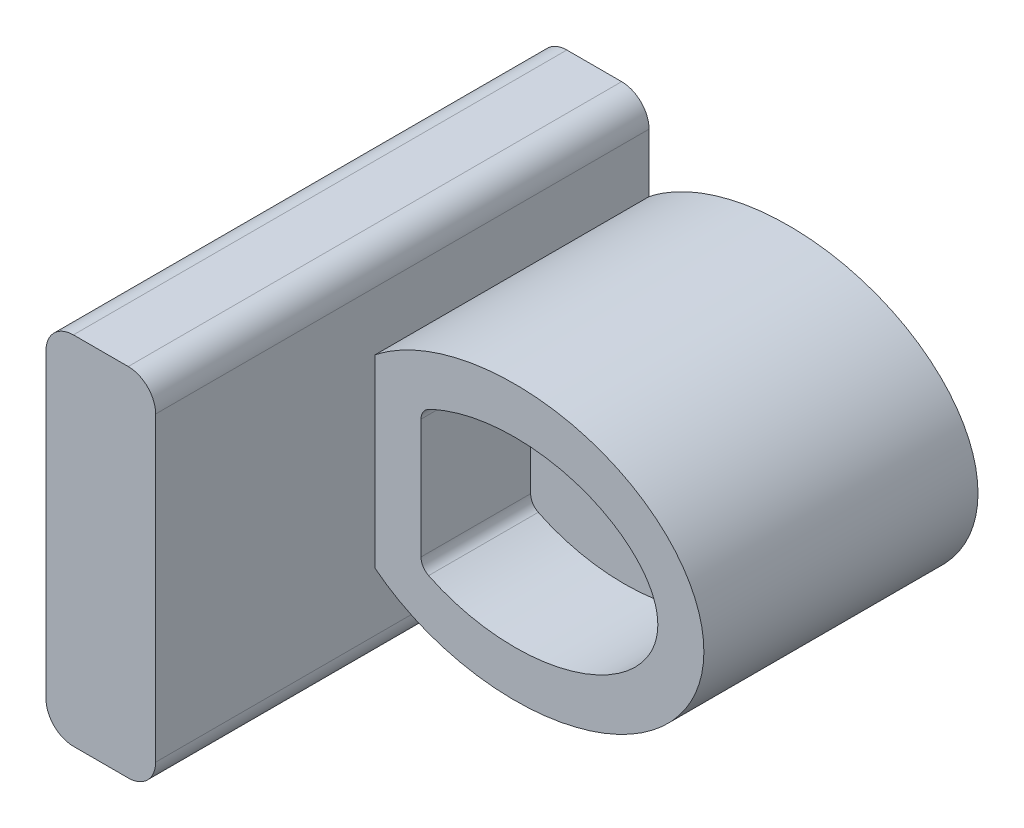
ISO-10303-21;
HEADER;
FILE_DESCRIPTION(('STEP AP214'),'2;1');
FILE_NAME('part.step','',(''),(''),'','','');
FILE_SCHEMA(('AUTOMOTIVE_DESIGN { 1 0 10303 214 1 1 1 1 }'));
ENDSEC;
DATA;
#1=APPLICATION_CONTEXT('core data for automotive mechanical design processes');
#2=APPLICATION_PROTOCOL_DEFINITION('international standard','automotive_design',2000,#1);
#3=PRODUCT_CONTEXT('',#1,'mechanical');
#4=PRODUCT('Part','Part','',(#3));
#5=PRODUCT_RELATED_PRODUCT_CATEGORY('part','',(#4));
#6=PRODUCT_DEFINITION_FORMATION('','',#4);
#7=PRODUCT_DEFINITION_CONTEXT('part definition',#1,'design');
#8=PRODUCT_DEFINITION('design','',#6,#7);
#9=PRODUCT_DEFINITION_SHAPE('','',#8);
#10=(LENGTH_UNIT() NAMED_UNIT(*) SI_UNIT(.MILLI.,.METRE.));
#11=(NAMED_UNIT(*) PLANE_ANGLE_UNIT() SI_UNIT($,.RADIAN.));
#12=(NAMED_UNIT(*) SI_UNIT($,.STERADIAN.) SOLID_ANGLE_UNIT());
#13=UNCERTAINTY_MEASURE_WITH_UNIT(LENGTH_MEASURE(1.E-05),#10,'distance_accuracy_value','');
#14=(GEOMETRIC_REPRESENTATION_CONTEXT(3) GLOBAL_UNCERTAINTY_ASSIGNED_CONTEXT((#13)) GLOBAL_UNIT_ASSIGNED_CONTEXT((#10,
#11,#12)) REPRESENTATION_CONTEXT('',''));
#15=CARTESIAN_POINT('',(0.,0.,0.));
#16=DIRECTION('',(0.,0.,1.));
#17=DIRECTION('',(1.,0.,0.));
#18=AXIS2_PLACEMENT_3D('',#15,#16,#17);
#19=CARTESIAN_POINT('',(100.000000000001,324.999999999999,900.000000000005));
#20=DIRECTION('',(-1.00000000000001,0.,0.));
#21=DIRECTION('',(0.,0.,1.));
#22=AXIS2_PLACEMENT_3D('',#19,#20,#21);
#23=PLANE('',#22);
#24=DIRECTION('',(0.,0.,-1.));
#25=VECTOR('',#24,1.);
#26=CARTESIAN_POINT('',(100.000000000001,-168.390580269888,500.000000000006));
#27=LINE('',#26,#25);
#28=CARTESIAN_POINT('',(100.000000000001,-168.390580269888,500.000000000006));
#29=VERTEX_POINT('',#28);
#30=CARTESIAN_POINT('',(100.000000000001,-168.390580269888,0.));
#31=VERTEX_POINT('',#30);
#32=EDGE_CURVE('E1195',#29,#31,#27,.T.);
#33=ORIENTED_EDGE('',*,*,#32,.F.);
#34=DIRECTION('',(0.,1.00000000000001,0.));
#35=VECTOR('',#34,1.);
#36=CARTESIAN_POINT('',(100.000000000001,324.999999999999,500.));
#37=LINE('',#36,#35);
#38=CARTESIAN_POINT('',(100.000000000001,168.390580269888,500.000000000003));
#39=VERTEX_POINT('',#38);
#40=EDGE_CURVE('E1191',#29,#39,#37,.T.);
#41=ORIENTED_EDGE('',*,*,#40,.T.);
#42=DIRECTION('',(0.,0.,-1.));
#43=VECTOR('',#42,1.);
#44=CARTESIAN_POINT('',(100.000000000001,168.390580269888,500.000000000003));
#45=LINE('',#44,#43);
#46=CARTESIAN_POINT('',(99.9999999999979,168.390580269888,0.));
#47=VERTEX_POINT('',#46);
#48=EDGE_CURVE('E1189',#47,#39,#45,.F.);
#49=ORIENTED_EDGE('',*,*,#48,.F.);
#50=DIRECTION('',(0.,1.00000000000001,0.));
#51=VECTOR('',#50,1.);
#52=CARTESIAN_POINT('',(99.9999999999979,324.999999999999,0.));
#53=LINE('',#52,#51);
#54=CARTESIAN_POINT('',(99.9999999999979,275.,0.));
#55=VERTEX_POINT('',#54);
#56=EDGE_CURVE('E1175',#47,#55,#53,.T.);
#57=ORIENTED_EDGE('',*,*,#56,.T.);
#58=DIRECTION('',(0.,0.,-1.));
#59=VECTOR('',#58,1.);
#60=CARTESIAN_POINT('',(100.000000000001,275.,900.000000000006));
#61=LINE('',#60,#59);
#62=CARTESIAN_POINT('',(100.000000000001,275.,900.000000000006));
#63=VERTEX_POINT('',#62);
#64=EDGE_CURVE('E1293',#55,#63,#61,.F.);
#65=ORIENTED_EDGE('',*,*,#64,.T.);
#66=DIRECTION('',(0.,1.00000000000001,0.));
#67=VECTOR('',#66,1.);
#68=CARTESIAN_POINT('',(100.000000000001,324.999999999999,900.000000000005));
#69=LINE('',#68,#67);
#70=CARTESIAN_POINT('',(100.000000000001,-275.000000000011,900.000000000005));
#71=VERTEX_POINT('',#70);
#72=EDGE_CURVE('E1263',#71,#63,#69,.T.);
#73=ORIENTED_EDGE('',*,*,#72,.F.);
#74=DIRECTION('',(0.,0.,-1.));
#75=VECTOR('',#74,1.);
#76=CARTESIAN_POINT('',(100.000000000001,-275.000000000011,900.000000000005));
#77=LINE('',#76,#75);
#78=CARTESIAN_POINT('',(100.000000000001,-275.000000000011,0.));
#79=VERTEX_POINT('',#78);
#80=EDGE_CURVE('E1295',#71,#79,#77,.T.);
#81=ORIENTED_EDGE('',*,*,#80,.T.);
#82=EDGE_CURVE('E1185',#79,#31,#53,.T.);
#83=ORIENTED_EDGE('',*,*,#82,.T.);
#84=EDGE_LOOP('',(#33,#41,#49,#57,#65,#73,#81,#83));
#85=FACE_BOUND('',#84,.T.);
#86=ADVANCED_FACE('F1072',(#85),#23,.F.);
#87=CARTESIAN_POINT('',(-99.9999999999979,324.999999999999,900.000000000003));
#88=DIRECTION('',(1.00000000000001,0.,0.));
#89=DIRECTION('',(0.,0.,-1.));
#90=AXIS2_PLACEMENT_3D('',#87,#88,#89);
#91=PLANE('',#90);
#92=DIRECTION('',(0.,-1.00000000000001,0.));
#93=VECTOR('',#92,1.);
#94=CARTESIAN_POINT('',(-100.000000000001,324.999999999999,0.));
#95=LINE('',#94,#93);
#96=CARTESIAN_POINT('',(-100.000000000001,275.,0.));
#97=VERTEX_POINT('',#96);
#98=CARTESIAN_POINT('',(-99.9999999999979,-275.000000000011,0.));
#99=VERTEX_POINT('',#98);
#100=EDGE_CURVE('E1490',#97,#99,#95,.T.);
#101=ORIENTED_EDGE('',*,*,#100,.T.);
#102=DIRECTION('',(0.,0.,-1.));
#103=VECTOR('',#102,1.);
#104=CARTESIAN_POINT('',(-99.9999999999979,-275.000000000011,900.000000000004));
#105=LINE('',#104,#103);
#106=CARTESIAN_POINT('',(-99.9999999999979,-275.000000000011,900.000000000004));
#107=VERTEX_POINT('',#106);
#108=EDGE_CURVE('E1284',#99,#107,#105,.F.);
#109=ORIENTED_EDGE('',*,*,#108,.T.);
#110=DIRECTION('',(0.,-1.00000000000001,0.));
#111=VECTOR('',#110,1.);
#112=CARTESIAN_POINT('',(-99.9999999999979,324.999999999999,900.000000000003));
#113=LINE('',#112,#111);
#114=CARTESIAN_POINT('',(-99.9999999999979,275.,900.000000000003));
#115=VERTEX_POINT('',#114);
#116=EDGE_CURVE('E1264',#115,#107,#113,.T.);
#117=ORIENTED_EDGE('',*,*,#116,.F.);
#118=DIRECTION('',(0.,0.,-1.));
#119=VECTOR('',#118,1.);
#120=CARTESIAN_POINT('',(-99.9999999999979,275.,900.000000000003));
#121=LINE('',#120,#119);
#122=EDGE_CURVE('E1281',#115,#97,#121,.T.);
#123=ORIENTED_EDGE('',*,*,#122,.T.);
#124=EDGE_LOOP('',(#101,#109,#117,#123));
#125=FACE_BOUND('',#124,.T.);
#126=ADVANCED_FACE('F1074',(#125),#91,.F.);
#127=CARTESIAN_POINT('',(-99.9999999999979,-325.00000000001,900.000000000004));
#128=DIRECTION('',(0.,1.00000000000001,0.));
#129=DIRECTION('',(0.,0.,1.));
#130=AXIS2_PLACEMENT_3D('',#127,#128,#129);
#131=PLANE('',#130);
#132=DIRECTION('',(1.00000000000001,0.,0.));
#133=VECTOR('',#132,1.);
#134=CARTESIAN_POINT('',(-99.9999999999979,-325.00000000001,900.000000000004));
#135=LINE('',#134,#133);
#136=CARTESIAN_POINT('',(-50.0000000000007,-325.00000000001,900.000000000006));
#137=VERTEX_POINT('',#136);
#138=CARTESIAN_POINT('',(50.0000000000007,-325.00000000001,900.000000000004));
#139=VERTEX_POINT('',#138);
#140=EDGE_CURVE('E1255',#137,#139,#135,.T.);
#141=ORIENTED_EDGE('',*,*,#140,.F.);
#142=DIRECTION('',(0.,0.,-1.));
#143=VECTOR('',#142,1.);
#144=CARTESIAN_POINT('',(-50.0000000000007,-325.00000000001,900.000000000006));
#145=LINE('',#144,#143);
#146=CARTESIAN_POINT('',(-50.0000000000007,-325.00000000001,0.));
#147=VERTEX_POINT('',#146);
#148=EDGE_CURVE('E1258',#137,#147,#145,.T.);
#149=ORIENTED_EDGE('',*,*,#148,.T.);
#150=DIRECTION('',(1.00000000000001,0.,0.));
#151=VECTOR('',#150,1.);
#152=CARTESIAN_POINT('',(-99.9999999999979,-325.00000000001,0.));
#153=LINE('',#152,#151);
#154=CARTESIAN_POINT('',(50.0000000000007,-325.00000000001,0.));
#155=VERTEX_POINT('',#154);
#156=EDGE_CURVE('E1186',#147,#155,#153,.T.);
#157=ORIENTED_EDGE('',*,*,#156,.T.);
#158=DIRECTION('',(0.,0.,-1.));
#159=VECTOR('',#158,1.);
#160=CARTESIAN_POINT('',(50.0000000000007,-325.00000000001,900.000000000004));
#161=LINE('',#160,#159);
#162=EDGE_CURVE('E1261',#155,#139,#161,.F.);
#163=ORIENTED_EDGE('',*,*,#162,.T.);
#164=EDGE_LOOP('',(#141,#149,#157,#163));
#165=FACE_BOUND('',#164,.T.);
#166=ADVANCED_FACE('F1243',(#165),#131,.F.);
#167=CARTESIAN_POINT('',(-99.9999999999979,324.999999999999,900.000000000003));
#168=DIRECTION('',(0.,-1.00000000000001,0.));
#169=DIRECTION('',(0.,0.,-1.));
#170=AXIS2_PLACEMENT_3D('',#167,#168,#169);
#171=PLANE('',#170);
#172=DIRECTION('',(-1.00000000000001,0.,0.));
#173=VECTOR('',#172,1.);
#174=CARTESIAN_POINT('',(-99.9999999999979,324.999999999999,900.000000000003));
#175=LINE('',#174,#173);
#176=CARTESIAN_POINT('',(50.0000000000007,324.999999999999,900.000000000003));
#177=VERTEX_POINT('',#176);
#178=CARTESIAN_POINT('',(-50.0000000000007,324.999999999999,900.000000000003));
#179=VERTEX_POINT('',#178);
#180=EDGE_CURVE('E1273',#177,#179,#175,.T.);
#181=ORIENTED_EDGE('',*,*,#180,.F.);
#182=DIRECTION('',(0.,0.,-1.));
#183=VECTOR('',#182,1.);
#184=CARTESIAN_POINT('',(50.0000000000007,324.999999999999,900.000000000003));
#185=LINE('',#184,#183);
#186=CARTESIAN_POINT('',(50.0000000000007,324.999999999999,0.));
#187=VERTEX_POINT('',#186);
#188=EDGE_CURVE('E1300',#177,#187,#185,.T.);
#189=ORIENTED_EDGE('',*,*,#188,.T.);
#190=DIRECTION('',(-1.00000000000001,0.,0.));
#191=VECTOR('',#190,1.);
#192=CARTESIAN_POINT('',(-100.000000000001,324.999999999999,0.));
#193=LINE('',#192,#191);
#194=CARTESIAN_POINT('',(-50.0000000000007,324.999999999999,0.));
#195=VERTEX_POINT('',#194);
#196=EDGE_CURVE('E1475',#187,#195,#193,.T.);
#197=ORIENTED_EDGE('',*,*,#196,.T.);
#198=DIRECTION('',(0.,0.,-1.));
#199=VECTOR('',#198,1.);
#200=CARTESIAN_POINT('',(-50.0000000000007,324.999999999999,900.000000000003));
#201=LINE('',#200,#199);
#202=EDGE_CURVE('E1298',#195,#179,#201,.F.);
#203=ORIENTED_EDGE('',*,*,#202,.T.);
#204=EDGE_LOOP('',(#181,#189,#197,#203));
#205=FACE_BOUND('',#204,.T.);
#206=ADVANCED_FACE('F1239',(#205),#171,.F.);
#207=CARTESIAN_POINT('',(-99.9999999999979,-325.00000000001,900.000000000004));
#208=DIRECTION('',(0.,0.,1.));
#209=DIRECTION('',(1.00000000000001,0.,0.));
#210=AXIS2_PLACEMENT_3D('',#207,#208,#209);
#211=PLANE('',#210);
#212=ORIENTED_EDGE('',*,*,#116,.T.);
#213=CARTESIAN_POINT('',(-50.0000000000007,-275.000000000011,900.000000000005));
#214=DIRECTION('',(0.,0.,1.));
#215=DIRECTION('',(1.00000000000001,0.,0.));
#216=AXIS2_PLACEMENT_3D('',#213,#214,#215);
#217=CIRCLE('',#216,50.);
#218=EDGE_CURVE('E1268',#107,#137,#217,.T.);
#219=ORIENTED_EDGE('',*,*,#218,.T.);
#220=ORIENTED_EDGE('',*,*,#140,.T.);
#221=CARTESIAN_POINT('',(50.0000000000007,-275.000000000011,900.000000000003));
#222=DIRECTION('',(0.,0.,1.));
#223=DIRECTION('',(1.00000000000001,0.,0.));
#224=AXIS2_PLACEMENT_3D('',#221,#222,#223);
#225=CIRCLE('',#224,50.);
#226=EDGE_CURVE('E1290',#139,#71,#225,.T.);
#227=ORIENTED_EDGE('',*,*,#226,.T.);
#228=ORIENTED_EDGE('',*,*,#72,.T.);
#229=CARTESIAN_POINT('',(50.0000000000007,275.,900.000000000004));
#230=DIRECTION('',(0.,0.,1.));
#231=DIRECTION('',(1.00000000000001,0.,0.));
#232=AXIS2_PLACEMENT_3D('',#229,#230,#231);
#233=CIRCLE('',#232,50.);
#234=EDGE_CURVE('E1288',#63,#177,#233,.T.);
#235=ORIENTED_EDGE('',*,*,#234,.T.);
#236=ORIENTED_EDGE('',*,*,#180,.T.);
#237=CARTESIAN_POINT('',(-50.0000000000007,275.,900.000000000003));
#238=DIRECTION('',(0.,0.,1.));
#239=DIRECTION('',(1.00000000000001,0.,0.));
#240=AXIS2_PLACEMENT_3D('',#237,#238,#239);
#241=CIRCLE('',#240,50.);
#242=EDGE_CURVE('E1286',#179,#115,#241,.T.);
#243=ORIENTED_EDGE('',*,*,#242,.T.);
#244=EDGE_LOOP('',(#212,#219,#220,#227,#228,#235,#236,#243));
#245=FACE_BOUND('',#244,.T.);
#246=ADVANCED_FACE('F1236',(#245),#211,.T.);
#247=CARTESIAN_POINT('',(-99.9999999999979,-325.00000000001,0.));
#248=DIRECTION('',(0.,0.,1.));
#249=DIRECTION('',(1.00000000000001,0.,0.));
#250=AXIS2_PLACEMENT_3D('',#247,#248,#249);
#251=PLANE('',#250);
#252=ORIENTED_EDGE('',*,*,#56,.F.);
#253=CARTESIAN_POINT('',(355.000000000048,0.,0.));
#254=DIRECTION('',(0.,0.,1.));
#255=DIRECTION('',(-1.00000000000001,0.,0.));
#256=AXIS2_PLACEMENT_3D('',#253,#254,#255);
#257=ELLIPSE('',#256,345.,250.);
#258=EDGE_CURVE('E1180',#31,#47,#257,.T.);
#259=ORIENTED_EDGE('',*,*,#258,.F.);
#260=ORIENTED_EDGE('',*,*,#82,.F.);
#261=CARTESIAN_POINT('',(50.0000000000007,-275.000000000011,0.));
#262=DIRECTION('',(0.,0.,1.));
#263=DIRECTION('',(1.00000000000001,0.,0.));
#264=AXIS2_PLACEMENT_3D('',#261,#262,#263);
#265=CIRCLE('',#264,50.);
#266=EDGE_CURVE('E1278',#79,#155,#265,.F.);
#267=ORIENTED_EDGE('',*,*,#266,.T.);
#268=ORIENTED_EDGE('',*,*,#156,.F.);
#269=CARTESIAN_POINT('',(-50.0000000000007,-275.000000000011,0.));
#270=DIRECTION('',(0.,0.,1.));
#271=DIRECTION('',(1.00000000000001,0.,0.));
#272=AXIS2_PLACEMENT_3D('',#269,#270,#271);
#273=CIRCLE('',#272,50.);
#274=EDGE_CURVE('E1269',#147,#99,#273,.F.);
#275=ORIENTED_EDGE('',*,*,#274,.T.);
#276=ORIENTED_EDGE('',*,*,#100,.F.);
#277=CARTESIAN_POINT('',(-50.0000000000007,275.,0.));
#278=DIRECTION('',(0.,0.,1.));
#279=DIRECTION('',(1.00000000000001,0.,0.));
#280=AXIS2_PLACEMENT_3D('',#277,#278,#279);
#281=CIRCLE('',#280,50.);
#282=EDGE_CURVE('E1270',#97,#195,#281,.F.);
#283=ORIENTED_EDGE('',*,*,#282,.T.);
#284=ORIENTED_EDGE('',*,*,#196,.F.);
#285=CARTESIAN_POINT('',(50.0000000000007,275.,0.));
#286=DIRECTION('',(0.,0.,1.));
#287=DIRECTION('',(1.00000000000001,0.,0.));
#288=AXIS2_PLACEMENT_3D('',#285,#286,#287);
#289=CIRCLE('',#288,50.);
#290=EDGE_CURVE('E1182',#187,#55,#289,.F.);
#291=ORIENTED_EDGE('',*,*,#290,.T.);
#292=EDGE_LOOP('',(#252,#259,#260,#267,#268,#275,#276,#283,#284,#291));
#293=FACE_BOUND('',#292,.T.);
#294=ADVANCED_FACE('F1177',(#293),#251,.F.);
#295=CARTESIAN_POINT('',(-50.0000000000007,-275.000000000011,900.000000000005));
#296=DIRECTION('',(0.,0.,-1.));
#297=DIRECTION('',(-1.00000000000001,0.,0.));
#298=AXIS2_PLACEMENT_3D('',#295,#296,#297);
#299=CYLINDRICAL_SURFACE('',#298,50.);
#300=ORIENTED_EDGE('',*,*,#218,.F.);
#301=ORIENTED_EDGE('',*,*,#108,.F.);
#302=ORIENTED_EDGE('',*,*,#274,.F.);
#303=ORIENTED_EDGE('',*,*,#148,.F.);
#304=EDGE_LOOP('',(#300,#301,#302,#303));
#305=FACE_BOUND('',#304,.T.);
#306=ADVANCED_FACE('F1229',(#305),#299,.T.);
#307=CARTESIAN_POINT('',(50.0000000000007,-275.000000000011,900.000000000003));
#308=DIRECTION('',(0.,0.,-1.));
#309=DIRECTION('',(-1.00000000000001,0.,0.));
#310=AXIS2_PLACEMENT_3D('',#307,#308,#309);
#311=CYLINDRICAL_SURFACE('',#310,50.);
#312=ORIENTED_EDGE('',*,*,#226,.F.);
#313=ORIENTED_EDGE('',*,*,#162,.F.);
#314=ORIENTED_EDGE('',*,*,#266,.F.);
#315=ORIENTED_EDGE('',*,*,#80,.F.);
#316=EDGE_LOOP('',(#312,#313,#314,#315));
#317=FACE_BOUND('',#316,.T.);
#318=ADVANCED_FACE('F1225',(#317),#311,.T.);
#319=CARTESIAN_POINT('',(50.0000000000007,275.,900.000000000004));
#320=DIRECTION('',(0.,0.,-1.));
#321=DIRECTION('',(-1.00000000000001,0.,0.));
#322=AXIS2_PLACEMENT_3D('',#319,#320,#321);
#323=CYLINDRICAL_SURFACE('',#322,50.);
#324=ORIENTED_EDGE('',*,*,#234,.F.);
#325=ORIENTED_EDGE('',*,*,#64,.F.);
#326=ORIENTED_EDGE('',*,*,#290,.F.);
#327=ORIENTED_EDGE('',*,*,#188,.F.);
#328=EDGE_LOOP('',(#324,#325,#326,#327));
#329=FACE_BOUND('',#328,.T.);
#330=ADVANCED_FACE('F1221',(#329),#323,.T.);
#331=CARTESIAN_POINT('',(-50.0000000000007,275.,900.000000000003));
#332=DIRECTION('',(0.,0.,-1.));
#333=DIRECTION('',(-1.00000000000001,0.,0.));
#334=AXIS2_PLACEMENT_3D('',#331,#332,#333);
#335=CYLINDRICAL_SURFACE('',#334,50.);
#336=ORIENTED_EDGE('',*,*,#242,.F.);
#337=ORIENTED_EDGE('',*,*,#202,.F.);
#338=ORIENTED_EDGE('',*,*,#282,.F.);
#339=ORIENTED_EDGE('',*,*,#122,.F.);
#340=EDGE_LOOP('',(#336,#337,#338,#339));
#341=FACE_BOUND('',#340,.T.);
#342=ADVANCED_FACE('F1218',(#341),#335,.T.);
#343=CARTESIAN_POINT('',(355.000000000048,0.,500.));
#344=DIRECTION('',(0.,0.,1.));
#345=DIRECTION('',(1.00000000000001,0.,0.));
#346=AXIS2_PLACEMENT_3D('',#343,#344,#345);
#347=PLANE('',#346);
#348=CARTESIAN_POINT('',(197.932725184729,-131.284545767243,500.));
#349=CARTESIAN_POINT('',(198.0631544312,-131.348939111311,500.));
#350=CARTESIAN_POINT('',(198.193621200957,-131.413228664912,500.));
#351=CARTESIAN_POINT('',(203.151743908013,-133.851788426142,500.));
#352=CARTESIAN_POINT('',(208.03060389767,-136.084426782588,500.));
#353=CARTESIAN_POINT('',(222.80981291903,-142.387825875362,499.999999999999));
#354=CARTESIAN_POINT('',(232.852073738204,-146.066054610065,499.999999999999));
#355=CARTESIAN_POINT('',(253.279093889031,-152.475151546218,500.));
#356=CARTESIAN_POINT('',(263.664109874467,-155.205309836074,500.));
#357=CARTESIAN_POINT('',(276.849909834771,-158.052272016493,500.));
#358=CARTESIAN_POINT('',(279.499889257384,-158.593745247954,500.));
#359=CARTESIAN_POINT('',(284.807524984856,-159.617703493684,500.));
#360=CARTESIAN_POINT('',(287.462975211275,-160.099832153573,500.));
#361=CARTESIAN_POINT('',(295.434123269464,-161.45849009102,500.));
#362=CARTESIAN_POINT('',(300.75461354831,-162.247381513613,500.));
#363=CARTESIAN_POINT('',(316.734653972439,-164.274480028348,500.000000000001));
#364=CARTESIAN_POINT('',(327.412708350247,-165.174306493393,500.000000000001));
#365=CARTESIAN_POINT('',(348.816727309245,-166.097841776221,500.));
#366=CARTESIAN_POINT('',(359.542695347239,-166.121487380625,500.));
#367=CARTESIAN_POINT('',(375.66803484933,-165.491550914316,500.));
#368=CARTESIAN_POINT('',(381.049228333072,-165.170383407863,500.));
#369=CARTESIAN_POINT('',(389.130346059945,-164.518063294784,499.999999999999));
#370=CARTESIAN_POINT('',(391.821648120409,-164.272442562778,499.999999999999));
#371=CARTESIAN_POINT('',(397.184915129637,-163.726252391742,499.999999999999));
#372=CARTESIAN_POINT('',(399.859081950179,-163.425510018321,499.999999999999));
#373=CARTESIAN_POINT('',(413.192657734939,-161.783839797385,499.999999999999));
#374=CARTESIAN_POINT('',(423.740710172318,-160.030586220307,499.999999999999));
#375=CARTESIAN_POINT('',(444.594510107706,-155.626883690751,499.999999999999));
#376=CARTESIAN_POINT('',(454.900350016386,-152.976776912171,499.999999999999));
#377=CARTESIAN_POINT('',(475.253270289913,-146.718440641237,500.));
#378=CARTESIAN_POINT('',(485.300598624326,-143.111129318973,500.));
#379=CARTESIAN_POINT('',(500.152781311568,-136.88996360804,500.));
#380=CARTESIAN_POINT('',(505.066891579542,-134.680656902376,500.));
#381=CARTESIAN_POINT('',(512.378157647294,-131.144904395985,500.));
#382=CARTESIAN_POINT('',(514.807204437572,-129.928147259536,500.));
#383=CARTESIAN_POINT('',(519.614398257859,-127.432738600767,500.));
#384=CARTESIAN_POINT('',(521.996023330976,-126.15248137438,500.));
#385=CARTESIAN_POINT('',(529.073173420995,-122.211369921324,500.000000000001));
#386=CARTESIAN_POINT('',(533.701122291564,-119.450396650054,500.000000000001));
#387=CARTESIAN_POINT('',(542.76390788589,-113.642340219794,500.000000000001));
#388=CARTESIAN_POINT('',(547.198808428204,-110.595351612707,500.000000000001));
#389=CARTESIAN_POINT('',(555.857265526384,-104.188252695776,500.000000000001));
#390=CARTESIAN_POINT('',(560.080933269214,-100.82830711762,500.000000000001));
#391=CARTESIAN_POINT('',(565.212019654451,-96.4083639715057,500.000000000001));
#392=CARTESIAN_POINT('',(566.230787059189,-95.5133378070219,500.000000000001));
#393=CARTESIAN_POINT('',(568.252898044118,-93.7004339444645,500.000000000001));
#394=CARTESIAN_POINT('',(569.257094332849,-92.781735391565,500.000000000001));
#395=CARTESIAN_POINT('',(572.234781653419,-90.0004046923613,500.000000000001));
#396=CARTESIAN_POINT('',(574.175950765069,-88.1103982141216,500.000000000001));
#397=CARTESIAN_POINT('',(579.861822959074,-82.3283249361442,500.000000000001));
#398=CARTESIAN_POINT('',(583.469466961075,-78.3246732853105,500.000000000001));
#399=CARTESIAN_POINT('',(590.276454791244,-69.9849577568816,500.000000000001));
#400=CARTESIAN_POINT('',(593.476159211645,-65.6491874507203,500.000000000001));
#401=CARTESIAN_POINT('',(597.921080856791,-58.8568105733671,500.000000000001));
#402=CARTESIAN_POINT('',(599.343408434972,-56.5443960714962,500.000000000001));
#403=CARTESIAN_POINT('',(601.379356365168,-52.9963606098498,500.000000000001));
#404=CARTESIAN_POINT('',(602.039992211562,-51.8033452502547,500.000000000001));
#405=CARTESIAN_POINT('',(603.319627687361,-49.4045970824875,500.000000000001));
#406=CARTESIAN_POINT('',(603.939360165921,-48.1975954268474,500.000000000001));
#407=CARTESIAN_POINT('',(606.935236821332,-42.1235532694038,500.000000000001));
#408=CARTESIAN_POINT('',(609.004344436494,-37.1399126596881,500.000000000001));
#409=CARTESIAN_POINT('',(611.556365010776,-29.4549607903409,500.000000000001));
#410=CARTESIAN_POINT('',(612.314838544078,-26.858296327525,500.000000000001));
#411=CARTESIAN_POINT('',(613.304029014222,-22.9068977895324,500.000000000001));
#412=CARTESIAN_POINT('',(613.608985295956,-21.5803568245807,500.000000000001));
#413=CARTESIAN_POINT('',(614.16738219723,-18.9077113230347,500.000000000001));
#414=CARTESIAN_POINT('',(614.420479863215,-17.562419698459,500.000000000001));
#415=CARTESIAN_POINT('',(615.542780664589,-10.8512305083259,500.000000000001));
#416=CARTESIAN_POINT('',(615.99401236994,-5.48023575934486,500.000000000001));
#417=CARTESIAN_POINT('',(616.005869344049,5.26582858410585,500.000000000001));
#418=CARTESIAN_POINT('',(615.566495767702,10.6408981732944,500.000000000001));
#419=CARTESIAN_POINT('',(614.456545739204,17.3623007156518,500.000000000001));
#420=CARTESIAN_POINT('',(614.205867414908,18.709334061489,500.000000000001));
#421=CARTESIAN_POINT('',(613.653151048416,21.3811798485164,500.000000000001));
#422=CARTESIAN_POINT('',(613.350896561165,22.7079948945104,500.000000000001));
#423=CARTESIAN_POINT('',(612.369196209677,26.6620843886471,500.000000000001));
#424=CARTESIAN_POINT('',(611.614889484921,29.2630299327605,500.000000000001));
#425=CARTESIAN_POINT('',(609.071562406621,36.9672461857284,500.000000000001));
#426=CARTESIAN_POINT('',(607.003127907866,41.9722456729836,500.000000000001));
#427=CARTESIAN_POINT('',(603.998412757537,48.0810703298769,500.000000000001));
#428=CARTESIAN_POINT('',(603.375351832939,49.2974223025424,500.));
#429=CARTESIAN_POINT('',(602.094215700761,51.7041937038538,500.));
#430=CARTESIAN_POINT('',(601.436358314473,52.8944106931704,500.));
#431=CARTESIAN_POINT('',(599.413344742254,56.4274037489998,500.));
#432=CARTESIAN_POINT('',(597.998822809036,58.7325795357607,500.));
#433=CARTESIAN_POINT('',(593.574015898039,65.5100614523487,500.));
#434=CARTESIAN_POINT('',(590.383279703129,69.8449237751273,500.));
#435=CARTESIAN_POINT('',(583.582387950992,78.1951903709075,500.));
#436=CARTESIAN_POINT('',(579.971902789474,82.2103435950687,500.));
#437=CARTESIAN_POINT('',(574.271437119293,88.0161978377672,500.));
#438=CARTESIAN_POINT('',(572.319503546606,89.9189479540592,500.));
#439=CARTESIAN_POINT('',(568.355761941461,93.6258523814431,500.));
#440=CARTESIAN_POINT('',(566.341866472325,95.4324976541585,500.));
#441=CARTESIAN_POINT('',(560.210651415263,100.721579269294,500.));
#442=CARTESIAN_POINT('',(556.004089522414,104.07357992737,499.999999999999));
#443=CARTESIAN_POINT('',(547.37901843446,110.467801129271,499.999999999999));
#444=CARTESIAN_POINT('',(542.96040020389,113.509862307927,499.999999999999));
#445=CARTESIAN_POINT('',(533.929195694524,119.310482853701,499.999999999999));
#446=CARTESIAN_POINT('',(529.316546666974,122.068950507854,499.999999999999));
#447=CARTESIAN_POINT('',(519.909846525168,127.320750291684,500.));
#448=CARTESIAN_POINT('',(515.114773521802,129.814504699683,500.));
#449=CARTESIAN_POINT('',(505.355784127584,134.54750333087,500.));
#450=CARTESIAN_POINT('',(500.433628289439,136.766652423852,500.));
#451=CARTESIAN_POINT('',(485.549515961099,143.017758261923,500.));
#452=CARTESIAN_POINT('',(475.470544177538,146.645547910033,500.));
#453=CARTESIAN_POINT('',(455.034747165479,152.941430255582,500.));
#454=CARTESIAN_POINT('',(444.677667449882,155.608643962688,499.999999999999));
#455=CARTESIAN_POINT('',(428.945836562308,158.931756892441,499.999999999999));
#456=CARTESIAN_POINT('',(423.669075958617,159.926112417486,499.999999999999));
#457=CARTESIAN_POINT('',(415.705348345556,161.249828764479,500.));
#458=CARTESIAN_POINT('',(413.042668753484,161.663077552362,500.));
#459=CARTESIAN_POINT('',(407.70113913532,162.433722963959,500.));
#460=CARTESIAN_POINT('',(405.019843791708,162.791411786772,500.));
#461=CARTESIAN_POINT('',(391.602659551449,164.436584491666,500.));
#462=CARTESIAN_POINT('',(380.878665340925,165.291516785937,500.));
#463=CARTESIAN_POINT('',(359.449282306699,166.121574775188,500.000000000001));
#464=CARTESIAN_POINT('',(348.743897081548,166.096530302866,500.));
#465=CARTESIAN_POINT('',(327.351664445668,165.169830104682,500.));
#466=CARTESIAN_POINT('',(316.66481456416,164.268291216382,500.));
#467=CARTESIAN_POINT('',(300.648990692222,162.232630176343,500.));
#468=CARTESIAN_POINT('',(295.312797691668,161.439878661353,500.));
#469=CARTESIAN_POINT('',(284.645421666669,159.61746520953,500.));
#470=CARTESIAN_POINT('',(279.349310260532,158.593748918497,500.));
#471=CARTESIAN_POINT('',(263.58018040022,155.183468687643,500.));
#472=CARTESIAN_POINT('',(253.223366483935,152.458872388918,500.));
#473=CARTESIAN_POINT('',(232.837909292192,146.06040065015,499.999999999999));
#474=CARTESIAN_POINT('',(222.809007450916,142.387273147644,499.999999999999));
#475=CARTESIAN_POINT('',(208.03863254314,136.087955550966,499.999999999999));
#476=CARTESIAN_POINT('',(203.160845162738,133.856073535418,499.999999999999));
#477=CARTESIAN_POINT('',(198.199134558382,131.415945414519,499.999999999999));
#478=CARTESIAN_POINT('',(198.065913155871,131.350301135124,499.999999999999));
#479=CARTESIAN_POINT('',(197.932729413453,131.28454791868,499.999999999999));
#480=B_SPLINE_CURVE_WITH_KNOTS('',3,(#348,#349,#350,#351,#352,#353,#354,#355,#356,#357,#358,
#359,#360,#361,#362,#363,#364,#365,#366,#367,#368,#369,#370,#371,#372,#373,#374,#375,#376,#377,
#378,#379,#380,#381,#382,#383,#384,#385,#386,#387,#388,#389,#390,#391,#392,#393,#394,#395,#396,
#397,#398,#399,#400,#401,#402,#403,#404,#405,#406,#407,#408,#409,#410,#411,#412,#413,#414,#415,
#416,#417,#418,#419,#420,#421,#422,#423,#424,#425,#426,#427,#428,#429,#430,#431,#432,#433,#434,
#435,#436,#437,#438,#439,#440,#441,#442,#443,#444,#445,#446,#447,#448,#449,#450,#451,#452,#453,
#454,#455,#456,#457,#458,#459,#460,#461,#462,#463,#464,#465,#466,#467,#468,#469,#470,#471,#472,
#473,#474,#475,#476,#477,#478,#479),.UNSPECIFIED.,.F.,.F.,(4,2,2,2,2,2,2,2,2,2,2,2,2,2,2,2,2,2,
2,2,2,2,2,2,2,2,2,2,2,2,2,2,2,2,2,2,2,2,2,2,2,2,2,2,2,2,2,2,2,2,2,2,2,2,2,2,2,2,2,2,2,2,2,2,2,
4),(0.0152026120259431,0.0156250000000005,0.031250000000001,0.062500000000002,0.093750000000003,
0.101562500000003,0.109375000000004,0.125000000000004,0.156250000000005,0.187500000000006,
0.203125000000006,0.210937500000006,0.218750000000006,0.250000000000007,0.281250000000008,
0.312500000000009,0.328125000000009,0.335937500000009,0.343750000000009,0.359375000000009,
0.375000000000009,0.390625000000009,0.39453125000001,0.39843750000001,0.40625000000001,
0.42187500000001,0.43750000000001,0.44531250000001,0.44921875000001,0.45312500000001,
0.46875000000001,0.47656250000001,0.480468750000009,0.484375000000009,0.500000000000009,
0.515625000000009,0.519531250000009,0.523437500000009,0.531250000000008,0.546875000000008,
0.550781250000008,0.554687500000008,0.562500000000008,0.578125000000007,0.593750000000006,
0.601562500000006,0.609375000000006,0.625000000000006,0.640625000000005,0.656250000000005,
0.671875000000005,0.687500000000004,0.718750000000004,0.750000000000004,0.765625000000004,
0.773437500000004,0.781250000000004,0.812500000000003,0.843750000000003,0.875000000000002,
0.890625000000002,0.906250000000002,0.937500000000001,0.968750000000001,0.984375,
0.984806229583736),.UNSPECIFIED.);
#481=CARTESIAN_POINT('',(197.932601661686,-131.284795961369,499.999999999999));
#482=VERTEX_POINT('',#481);
#483=CARTESIAN_POINT('',(197.932602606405,131.28480476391,499.999999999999));
#484=VERTEX_POINT('',#483);
#485=EDGE_CURVE('E1318',#482,#484,#480,.T.);
#486=ORIENTED_EDGE('',*,*,#485,.F.);
#487=CARTESIAN_POINT('',(209.000000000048,-108.86768987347,499.999999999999));
#488=DIRECTION('',(0.,0.,1.));
#489=DIRECTION('',(1.00000000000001,0.,0.));
#490=AXIS2_PLACEMENT_3D('',#487,#488,#489);
#491=CIRCLE('',#490,25.);
#492=CARTESIAN_POINT('',(184.000000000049,-108.86768987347,499.999999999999));
#493=VERTEX_POINT('',#492);
#494=EDGE_CURVE('E1081',#482,#493,#491,.F.);
#495=ORIENTED_EDGE('',*,*,#494,.T.);
#496=DIRECTION('',(0.,-1.00000000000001,0.));
#497=VECTOR('',#496,1.);
#498=CARTESIAN_POINT('',(184.000000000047,123.915241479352,499.999999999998));
#499=LINE('',#498,#497);
#500=CARTESIAN_POINT('',(184.000000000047,108.867689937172,499.999999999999));
#501=VERTEX_POINT('',#500);
#502=EDGE_CURVE('E1369',#501,#493,#499,.T.);
#503=ORIENTED_EDGE('',*,*,#502,.F.);
#504=CARTESIAN_POINT('',(209.000000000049,108.867689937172,499.999999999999));
#505=DIRECTION('',(0.,0.,1.));
#506=DIRECTION('',(1.00000000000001,0.,0.));
#507=AXIS2_PLACEMENT_3D('',#504,#505,#506);
#508=CIRCLE('',#507,25.);
#509=EDGE_CURVE('E11',#501,#484,#508,.F.);
#510=ORIENTED_EDGE('',*,*,#509,.T.);
#511=EDGE_LOOP('',(#486,#495,#503,#510));
#512=FACE_BOUND('',#511,.T.);
#513=ORIENTED_EDGE('',*,*,#40,.F.);
#514=CARTESIAN_POINT('',(355.000000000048,0.,500.));
#515=DIRECTION('',(0.,0.,1.));
#516=DIRECTION('',(-1.00000000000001,0.,0.));
#517=AXIS2_PLACEMENT_3D('',#514,#515,#516);
#518=ELLIPSE('',#517,345.,250.);
#519=EDGE_CURVE('E1196',#29,#39,#518,.T.);
#520=ORIENTED_EDGE('',*,*,#519,.T.);
#521=EDGE_LOOP('',(#513,#520));
#522=FACE_BOUND('',#521,.T.);
#523=ADVANCED_FACE('F1215',(#512,#522),#347,.T.);
#524=DIRECTION('',(0.,0.,-1.));
#525=VECTOR('',#524,1.);
#526=SURFACE_OF_LINEAR_EXTRUSION('',#518,#525);
#527=ORIENTED_EDGE('',*,*,#519,.F.);
#528=ORIENTED_EDGE('',*,*,#32,.T.);
#529=ORIENTED_EDGE('',*,*,#258,.T.);
#530=ORIENTED_EDGE('',*,*,#48,.T.);
#531=EDGE_LOOP('',(#527,#528,#529,#530));
#532=FACE_BOUND('',#531,.T.);
#533=ADVANCED_FACE('F1199',(#532),#526,.F.);
#534=CARTESIAN_POINT('',(184.000000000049,-123.915241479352,300.));
#535=CARTESIAN_POINT('',(188.720097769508,-126.587020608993,300.));
#536=CARTESIAN_POINT('',(193.496506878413,-129.103040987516,300.));
#537=CARTESIAN_POINT('',(203.151743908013,-133.851788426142,300.));
#538=CARTESIAN_POINT('',(208.03060389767,-136.084426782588,300.));
#539=CARTESIAN_POINT('',(222.80981291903,-142.387825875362,299.999999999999));
#540=CARTESIAN_POINT('',(232.852073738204,-146.066054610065,299.999999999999));
#541=CARTESIAN_POINT('',(253.279093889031,-152.475151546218,300.));
#542=CARTESIAN_POINT('',(263.664109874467,-155.205309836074,300.));
#543=CARTESIAN_POINT('',(276.849909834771,-158.052272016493,300.));
#544=CARTESIAN_POINT('',(279.499889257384,-158.593745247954,300.));
#545=CARTESIAN_POINT('',(284.807524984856,-159.617703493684,300.000000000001));
#546=CARTESIAN_POINT('',(287.462975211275,-160.099832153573,300.000000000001));
#547=CARTESIAN_POINT('',(295.434123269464,-161.45849009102,300.000000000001));
#548=CARTESIAN_POINT('',(300.75461354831,-162.247381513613,300.000000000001));
#549=CARTESIAN_POINT('',(316.734653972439,-164.274480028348,300.000000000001));
#550=CARTESIAN_POINT('',(327.412708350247,-165.174306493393,300.000000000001));
#551=CARTESIAN_POINT('',(348.816727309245,-166.097841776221,300.));
#552=CARTESIAN_POINT('',(359.542695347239,-166.121487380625,300.));
#553=CARTESIAN_POINT('',(375.66803484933,-165.491550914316,300.));
#554=CARTESIAN_POINT('',(381.049228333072,-165.170383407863,300.));
#555=CARTESIAN_POINT('',(389.130346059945,-164.518063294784,299.999999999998));
#556=CARTESIAN_POINT('',(391.821648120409,-164.272442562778,299.999999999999));
#557=CARTESIAN_POINT('',(397.184915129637,-163.726252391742,299.999999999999));
#558=CARTESIAN_POINT('',(399.859081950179,-163.425510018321,299.999999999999));
#559=CARTESIAN_POINT('',(413.192657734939,-161.783839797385,299.999999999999));
#560=CARTESIAN_POINT('',(423.740710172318,-160.030586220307,299.999999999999));
#561=CARTESIAN_POINT('',(444.594510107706,-155.626883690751,299.999999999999));
#562=CARTESIAN_POINT('',(454.900350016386,-152.976776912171,299.999999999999));
#563=CARTESIAN_POINT('',(475.253270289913,-146.718440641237,300.));
#564=CARTESIAN_POINT('',(485.300598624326,-143.111129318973,300.));
#565=CARTESIAN_POINT('',(500.152781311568,-136.88996360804,300.));
#566=CARTESIAN_POINT('',(505.066891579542,-134.680656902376,300.));
#567=CARTESIAN_POINT('',(512.378157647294,-131.144904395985,300.));
#568=CARTESIAN_POINT('',(514.807204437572,-129.928147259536,300.));
#569=CARTESIAN_POINT('',(519.614398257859,-127.432738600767,300.));
#570=CARTESIAN_POINT('',(521.996023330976,-126.15248137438,300.));
#571=CARTESIAN_POINT('',(529.073173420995,-122.211369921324,300.000000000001));
#572=CARTESIAN_POINT('',(533.701122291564,-119.450396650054,300.000000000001));
#573=CARTESIAN_POINT('',(542.76390788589,-113.642340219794,300.000000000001));
#574=CARTESIAN_POINT('',(547.198808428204,-110.595351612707,300.000000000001));
#575=CARTESIAN_POINT('',(555.857265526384,-104.188252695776,300.000000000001));
#576=CARTESIAN_POINT('',(560.080933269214,-100.82830711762,300.000000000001));
#577=CARTESIAN_POINT('',(565.212019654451,-96.4083639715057,300.000000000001));
#578=CARTESIAN_POINT('',(566.230787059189,-95.5133378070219,300.000000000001));
#579=CARTESIAN_POINT('',(568.252898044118,-93.7004339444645,300.000000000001));
#580=CARTESIAN_POINT('',(569.257094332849,-92.781735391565,300.000000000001));
#581=CARTESIAN_POINT('',(572.234781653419,-90.0004046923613,300.000000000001));
#582=CARTESIAN_POINT('',(574.175950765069,-88.1103982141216,300.000000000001));
#583=CARTESIAN_POINT('',(579.861822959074,-82.3283249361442,300.000000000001));
#584=CARTESIAN_POINT('',(583.469466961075,-78.3246732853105,300.000000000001));
#585=CARTESIAN_POINT('',(590.276454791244,-69.9849577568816,300.000000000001));
#586=CARTESIAN_POINT('',(593.476159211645,-65.6491874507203,300.000000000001));
#587=CARTESIAN_POINT('',(597.921080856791,-58.8568105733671,300.000000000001));
#588=CARTESIAN_POINT('',(599.343408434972,-56.5443960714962,300.000000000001));
#589=CARTESIAN_POINT('',(601.379356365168,-52.9963606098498,300.000000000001));
#590=CARTESIAN_POINT('',(602.039992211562,-51.8033452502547,300.000000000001));
#591=CARTESIAN_POINT('',(603.319627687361,-49.4045970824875,300.000000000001));
#592=CARTESIAN_POINT('',(603.939360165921,-48.1975954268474,300.000000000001));
#593=CARTESIAN_POINT('',(606.935236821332,-42.1235532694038,300.000000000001));
#594=CARTESIAN_POINT('',(609.004344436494,-37.1399126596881,300.000000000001));
#595=CARTESIAN_POINT('',(611.556365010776,-29.4549607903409,300.000000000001));
#596=CARTESIAN_POINT('',(612.314838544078,-26.858296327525,300.000000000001));
#597=CARTESIAN_POINT('',(613.304029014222,-22.9068977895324,300.000000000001));
#598=CARTESIAN_POINT('',(613.608985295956,-21.5803568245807,300.000000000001));
#599=CARTESIAN_POINT('',(614.16738219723,-18.9077113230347,300.000000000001));
#600=CARTESIAN_POINT('',(614.420479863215,-17.562419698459,300.000000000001));
#601=CARTESIAN_POINT('',(615.542780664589,-10.8512305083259,300.000000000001));
#602=CARTESIAN_POINT('',(615.99401236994,-5.48023575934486,300.000000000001));
#603=CARTESIAN_POINT('',(616.005869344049,5.26582858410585,300.000000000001));
#604=CARTESIAN_POINT('',(615.566495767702,10.6408981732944,300.000000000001));
#605=CARTESIAN_POINT('',(614.456545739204,17.3623007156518,300.000000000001));
#606=CARTESIAN_POINT('',(614.205867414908,18.709334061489,300.000000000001));
#607=CARTESIAN_POINT('',(613.653151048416,21.3811798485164,300.000000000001));
#608=CARTESIAN_POINT('',(613.350896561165,22.7079948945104,300.000000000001));
#609=CARTESIAN_POINT('',(612.369196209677,26.6620843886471,300.000000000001));
#610=CARTESIAN_POINT('',(611.614889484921,29.2630299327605,300.000000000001));
#611=CARTESIAN_POINT('',(609.071562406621,36.9672461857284,300.000000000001));
#612=CARTESIAN_POINT('',(607.003127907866,41.9722456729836,300.000000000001));
#613=CARTESIAN_POINT('',(603.998412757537,48.0810703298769,300.000000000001));
#614=CARTESIAN_POINT('',(603.375351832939,49.2974223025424,300.000000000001));
#615=CARTESIAN_POINT('',(602.094215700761,51.7041937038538,300.000000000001));
#616=CARTESIAN_POINT('',(601.436358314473,52.8944106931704,300.000000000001));
#617=CARTESIAN_POINT('',(599.413344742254,56.4274037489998,300.000000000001));
#618=CARTESIAN_POINT('',(597.998822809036,58.7325795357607,300.000000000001));
#619=CARTESIAN_POINT('',(593.574015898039,65.5100614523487,300.000000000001));
#620=CARTESIAN_POINT('',(590.383279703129,69.8449237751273,300.000000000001));
#621=CARTESIAN_POINT('',(583.582387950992,78.1951903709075,300.000000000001));
#622=CARTESIAN_POINT('',(579.971902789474,82.2103435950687,300.));
#623=CARTESIAN_POINT('',(574.271437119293,88.0161978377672,300.));
#624=CARTESIAN_POINT('',(572.319503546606,89.9189479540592,300.));
#625=CARTESIAN_POINT('',(568.355761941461,93.6258523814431,300.));
#626=CARTESIAN_POINT('',(566.341866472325,95.4324976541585,300.));
#627=CARTESIAN_POINT('',(560.210651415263,100.721579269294,300.));
#628=CARTESIAN_POINT('',(556.004089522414,104.07357992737,299.999999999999));
#629=CARTESIAN_POINT('',(547.37901843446,110.467801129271,299.999999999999));
#630=CARTESIAN_POINT('',(542.96040020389,113.509862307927,299.999999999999));
#631=CARTESIAN_POINT('',(533.929195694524,119.310482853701,299.999999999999));
#632=CARTESIAN_POINT('',(529.316546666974,122.068950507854,299.999999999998));
#633=CARTESIAN_POINT('',(519.909846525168,127.320750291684,300.));
#634=CARTESIAN_POINT('',(515.114773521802,129.814504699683,300.));
#635=CARTESIAN_POINT('',(505.355784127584,134.54750333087,300.));
#636=CARTESIAN_POINT('',(500.433628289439,136.766652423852,300.));
#637=CARTESIAN_POINT('',(485.549515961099,143.017758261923,300.));
#638=CARTESIAN_POINT('',(475.470544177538,146.645547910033,300.));
#639=CARTESIAN_POINT('',(455.034747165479,152.941430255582,300.));
#640=CARTESIAN_POINT('',(444.677667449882,155.608643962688,299.999999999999));
#641=CARTESIAN_POINT('',(428.945836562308,158.931756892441,299.999999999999));
#642=CARTESIAN_POINT('',(423.669075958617,159.926112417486,299.999999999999));
#643=CARTESIAN_POINT('',(415.705348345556,161.249828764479,300.));
#644=CARTESIAN_POINT('',(413.042668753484,161.663077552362,300.));
#645=CARTESIAN_POINT('',(407.70113913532,162.433722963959,300.));
#646=CARTESIAN_POINT('',(405.019843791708,162.791411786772,300.));
#647=CARTESIAN_POINT('',(391.602659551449,164.436584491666,300.));
#648=CARTESIAN_POINT('',(380.878665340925,165.291516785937,300.));
#649=CARTESIAN_POINT('',(359.449282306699,166.121574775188,300.000000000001));
#650=CARTESIAN_POINT('',(348.743897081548,166.096530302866,300.));
#651=CARTESIAN_POINT('',(327.351664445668,165.169830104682,300.));
#652=CARTESIAN_POINT('',(316.66481456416,164.268291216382,300.));
#653=CARTESIAN_POINT('',(300.648990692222,162.232630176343,300.));
#654=CARTESIAN_POINT('',(295.312797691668,161.439878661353,300.));
#655=CARTESIAN_POINT('',(284.645421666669,159.61746520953,300.));
#656=CARTESIAN_POINT('',(279.349310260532,158.593748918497,300.));
#657=CARTESIAN_POINT('',(263.58018040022,155.183468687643,300.));
#658=CARTESIAN_POINT('',(253.223366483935,152.458872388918,300.));
#659=CARTESIAN_POINT('',(232.837909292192,146.06040065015,299.999999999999));
#660=CARTESIAN_POINT('',(222.809007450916,142.387273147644,299.999999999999));
#661=CARTESIAN_POINT('',(208.03863254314,136.087955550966,299.999999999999));
#662=CARTESIAN_POINT('',(203.160845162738,133.856073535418,299.999999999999));
#663=CARTESIAN_POINT('',(193.503941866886,129.106888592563,299.999999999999));
#664=CARTESIAN_POINT('',(188.724793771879,126.589678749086,299.999999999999));
#665=CARTESIAN_POINT('',(184.000000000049,123.915241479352,299.999999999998));
#666=B_SPLINE_CURVE_WITH_KNOTS('',3,(#534,#535,#536,#537,#538,#539,#540,#541,#542,#543,#544,
#545,#546,#547,#548,#549,#550,#551,#552,#553,#554,#555,#556,#557,#558,#559,#560,#561,#562,#563,
#564,#565,#566,#567,#568,#569,#570,#571,#572,#573,#574,#575,#576,#577,#578,#579,#580,#581,#582,
#583,#584,#585,#586,#587,#588,#589,#590,#591,#592,#593,#594,#595,#596,#597,#598,#599,#600,#601,
#602,#603,#604,#605,#606,#607,#608,#609,#610,#611,#612,#613,#614,#615,#616,#617,#618,#619,#620,
#621,#622,#623,#624,#625,#626,#627,#628,#629,#630,#631,#632,#633,#634,#635,#636,#637,#638,#639,
#640,#641,#642,#643,#644,#645,#646,#647,#648,#649,#650,#651,#652,#653,#654,#655,#656,#657,#658,
#659,#660,#661,#662,#663,#664,#665),.UNSPECIFIED.,.F.,.F.,(4,2,2,2,2,2,2,2,2,2,2,2,2,2,2,2,2,2,
2,2,2,2,2,2,2,2,2,2,2,2,2,2,2,2,2,2,2,2,2,2,2,2,2,2,2,2,2,2,2,2,2,2,2,2,2,2,2,2,2,2,2,2,2,2,2,
4),(0.,0.0156250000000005,0.031250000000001,0.062500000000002,0.093750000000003,
0.101562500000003,0.109375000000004,0.125000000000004,0.156250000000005,0.187500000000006,
0.203125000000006,0.210937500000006,0.218750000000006,0.250000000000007,0.281250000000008,
0.312500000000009,0.328125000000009,0.335937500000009,0.343750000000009,0.359375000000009,
0.375000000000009,0.390625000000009,0.39453125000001,0.39843750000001,0.40625000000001,
0.42187500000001,0.43750000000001,0.44531250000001,0.44921875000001,0.45312500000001,
0.46875000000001,0.47656250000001,0.480468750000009,0.484375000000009,0.500000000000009,
0.515625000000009,0.519531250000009,0.523437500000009,0.531250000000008,0.546875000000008,
0.550781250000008,0.554687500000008,0.562500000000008,0.578125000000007,0.593750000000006,
0.601562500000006,0.609375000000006,0.625000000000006,0.640625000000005,0.656250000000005,
0.671875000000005,0.687500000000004,0.718750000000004,0.750000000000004,0.765625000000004,
0.773437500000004,0.781250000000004,0.812500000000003,0.843750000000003,0.875000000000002,
0.890625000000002,0.906250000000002,0.937500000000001,0.968750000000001,0.984375,1.),.UNSPECIFIED.);
#667=DIRECTION('',(0.,0.,1.));
#668=VECTOR('',#667,1.);
#669=SURFACE_OF_LINEAR_EXTRUSION('',#666,#668);
#670=CARTESIAN_POINT('',(197.932729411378,131.284547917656,299.999999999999));
#671=CARTESIAN_POINT('',(198.065913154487,131.350301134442,299.999999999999));
#672=CARTESIAN_POINT('',(198.19913455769,131.415945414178,299.999999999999));
#673=CARTESIAN_POINT('',(203.160845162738,133.856073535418,299.999999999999));
#674=CARTESIAN_POINT('',(208.03863254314,136.087955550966,299.999999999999));
#675=CARTESIAN_POINT('',(222.809007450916,142.387273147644,299.999999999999));
#676=CARTESIAN_POINT('',(232.837909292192,146.06040065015,299.999999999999));
#677=CARTESIAN_POINT('',(253.223366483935,152.458872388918,300.));
#678=CARTESIAN_POINT('',(263.58018040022,155.183468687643,300.));
#679=CARTESIAN_POINT('',(279.349310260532,158.593748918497,300.));
#680=CARTESIAN_POINT('',(284.645421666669,159.61746520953,300.));
#681=CARTESIAN_POINT('',(295.312797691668,161.439878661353,300.));
#682=CARTESIAN_POINT('',(300.648990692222,162.232630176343,300.));
#683=CARTESIAN_POINT('',(316.66481456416,164.268291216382,300.));
#684=CARTESIAN_POINT('',(327.351664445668,165.169830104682,300.));
#685=CARTESIAN_POINT('',(348.743897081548,166.096530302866,300.));
#686=CARTESIAN_POINT('',(359.449282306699,166.121574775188,300.000000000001));
#687=CARTESIAN_POINT('',(380.878665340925,165.291516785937,300.));
#688=CARTESIAN_POINT('',(391.602659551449,164.436584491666,300.));
#689=CARTESIAN_POINT('',(405.019843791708,162.791411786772,300.));
#690=CARTESIAN_POINT('',(407.70113913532,162.433722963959,300.));
#691=CARTESIAN_POINT('',(413.042668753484,161.663077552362,300.));
#692=CARTESIAN_POINT('',(415.705348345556,161.249828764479,300.));
#693=CARTESIAN_POINT('',(423.669075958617,159.926112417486,299.999999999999));
#694=CARTESIAN_POINT('',(428.945836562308,158.931756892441,299.999999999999));
#695=CARTESIAN_POINT('',(444.677667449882,155.608643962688,299.999999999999));
#696=CARTESIAN_POINT('',(455.034747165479,152.941430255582,300.));
#697=CARTESIAN_POINT('',(475.470544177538,146.645547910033,300.));
#698=CARTESIAN_POINT('',(485.549515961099,143.017758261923,300.));
#699=CARTESIAN_POINT('',(500.433628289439,136.766652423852,300.));
#700=CARTESIAN_POINT('',(505.355784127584,134.54750333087,300.));
#701=CARTESIAN_POINT('',(515.114773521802,129.814504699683,300.));
#702=CARTESIAN_POINT('',(519.909846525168,127.320750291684,300.));
#703=CARTESIAN_POINT('',(529.316546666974,122.068950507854,299.999999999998));
#704=CARTESIAN_POINT('',(533.929195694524,119.310482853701,299.999999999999));
#705=CARTESIAN_POINT('',(542.96040020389,113.509862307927,299.999999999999));
#706=CARTESIAN_POINT('',(547.37901843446,110.467801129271,299.999999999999));
#707=CARTESIAN_POINT('',(556.004089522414,104.07357992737,299.999999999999));
#708=CARTESIAN_POINT('',(560.210651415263,100.721579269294,300.));
#709=CARTESIAN_POINT('',(566.341866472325,95.4324976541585,300.));
#710=CARTESIAN_POINT('',(568.355761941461,93.6258523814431,300.));
#711=CARTESIAN_POINT('',(572.319503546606,89.9189479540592,300.));
#712=CARTESIAN_POINT('',(574.271437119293,88.0161978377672,300.));
#713=CARTESIAN_POINT('',(579.971902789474,82.2103435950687,300.));
#714=CARTESIAN_POINT('',(583.582387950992,78.1951903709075,300.000000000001));
#715=CARTESIAN_POINT('',(590.383279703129,69.8449237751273,300.000000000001));
#716=CARTESIAN_POINT('',(593.574015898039,65.5100614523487,300.000000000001));
#717=CARTESIAN_POINT('',(597.998822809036,58.7325795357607,300.000000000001));
#718=CARTESIAN_POINT('',(599.413344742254,56.4274037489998,300.000000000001));
#719=CARTESIAN_POINT('',(601.436358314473,52.8944106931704,300.000000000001));
#720=CARTESIAN_POINT('',(602.094215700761,51.7041937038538,300.000000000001));
#721=CARTESIAN_POINT('',(603.375351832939,49.2974223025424,300.000000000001));
#722=CARTESIAN_POINT('',(603.998412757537,48.0810703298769,300.000000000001));
#723=CARTESIAN_POINT('',(607.003127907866,41.9722456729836,300.000000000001));
#724=CARTESIAN_POINT('',(609.071562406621,36.9672461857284,300.000000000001));
#725=CARTESIAN_POINT('',(611.614889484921,29.2630299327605,300.000000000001));
#726=CARTESIAN_POINT('',(612.369196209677,26.6620843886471,300.000000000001));
#727=CARTESIAN_POINT('',(613.350896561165,22.7079948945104,300.000000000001));
#728=CARTESIAN_POINT('',(613.653151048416,21.3811798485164,300.000000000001));
#729=CARTESIAN_POINT('',(614.205867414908,18.709334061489,300.000000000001));
#730=CARTESIAN_POINT('',(614.456545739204,17.3623007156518,300.000000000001));
#731=CARTESIAN_POINT('',(615.566495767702,10.6408981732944,300.000000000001));
#732=CARTESIAN_POINT('',(616.005869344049,5.26582858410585,300.000000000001));
#733=CARTESIAN_POINT('',(615.99401236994,-5.48023575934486,300.000000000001));
#734=CARTESIAN_POINT('',(615.542780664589,-10.8512305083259,300.000000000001));
#735=CARTESIAN_POINT('',(614.420479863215,-17.562419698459,300.000000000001));
#736=CARTESIAN_POINT('',(614.16738219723,-18.9077113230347,300.000000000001));
#737=CARTESIAN_POINT('',(613.608985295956,-21.5803568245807,300.000000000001));
#738=CARTESIAN_POINT('',(613.304029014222,-22.9068977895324,300.000000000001));
#739=CARTESIAN_POINT('',(612.314838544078,-26.858296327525,300.000000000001));
#740=CARTESIAN_POINT('',(611.556365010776,-29.4549607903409,300.000000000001));
#741=CARTESIAN_POINT('',(609.004344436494,-37.1399126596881,300.000000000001));
#742=CARTESIAN_POINT('',(606.935236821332,-42.1235532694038,300.000000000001));
#743=CARTESIAN_POINT('',(603.939360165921,-48.1975954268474,300.000000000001));
#744=CARTESIAN_POINT('',(603.319627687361,-49.4045970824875,300.000000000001));
#745=CARTESIAN_POINT('',(602.039992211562,-51.8033452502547,300.000000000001));
#746=CARTESIAN_POINT('',(601.379356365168,-52.9963606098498,300.000000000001));
#747=CARTESIAN_POINT('',(599.343408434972,-56.5443960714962,300.000000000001));
#748=CARTESIAN_POINT('',(597.921080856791,-58.8568105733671,300.000000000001));
#749=CARTESIAN_POINT('',(593.476159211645,-65.6491874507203,300.000000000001));
#750=CARTESIAN_POINT('',(590.276454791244,-69.9849577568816,300.000000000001));
#751=CARTESIAN_POINT('',(583.469466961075,-78.3246732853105,300.000000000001));
#752=CARTESIAN_POINT('',(579.861822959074,-82.3283249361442,300.000000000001));
#753=CARTESIAN_POINT('',(574.175950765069,-88.1103982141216,300.000000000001));
#754=CARTESIAN_POINT('',(572.234781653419,-90.0004046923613,300.000000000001));
#755=CARTESIAN_POINT('',(569.257094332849,-92.781735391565,300.000000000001));
#756=CARTESIAN_POINT('',(568.252898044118,-93.7004339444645,300.000000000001));
#757=CARTESIAN_POINT('',(566.230787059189,-95.5133378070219,300.000000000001));
#758=CARTESIAN_POINT('',(565.212019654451,-96.4083639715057,300.000000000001));
#759=CARTESIAN_POINT('',(560.080933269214,-100.82830711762,300.000000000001));
#760=CARTESIAN_POINT('',(555.857265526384,-104.188252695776,300.000000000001));
#761=CARTESIAN_POINT('',(547.198808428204,-110.595351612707,300.000000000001));
#762=CARTESIAN_POINT('',(542.76390788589,-113.642340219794,300.000000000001));
#763=CARTESIAN_POINT('',(533.701122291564,-119.450396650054,300.000000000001));
#764=CARTESIAN_POINT('',(529.073173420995,-122.211369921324,300.000000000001));
#765=CARTESIAN_POINT('',(521.996023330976,-126.15248137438,300.));
#766=CARTESIAN_POINT('',(519.614398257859,-127.432738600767,300.));
#767=CARTESIAN_POINT('',(514.807204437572,-129.928147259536,300.));
#768=CARTESIAN_POINT('',(512.378157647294,-131.144904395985,300.));
#769=CARTESIAN_POINT('',(505.066891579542,-134.680656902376,300.));
#770=CARTESIAN_POINT('',(500.152781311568,-136.88996360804,300.));
#771=CARTESIAN_POINT('',(485.300598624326,-143.111129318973,300.));
#772=CARTESIAN_POINT('',(475.253270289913,-146.718440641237,300.));
#773=CARTESIAN_POINT('',(454.900350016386,-152.976776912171,299.999999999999));
#774=CARTESIAN_POINT('',(444.594510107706,-155.626883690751,299.999999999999));
#775=CARTESIAN_POINT('',(423.740710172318,-160.030586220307,299.999999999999));
#776=CARTESIAN_POINT('',(413.192657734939,-161.783839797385,299.999999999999));
#777=CARTESIAN_POINT('',(399.859081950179,-163.425510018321,299.999999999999));
#778=CARTESIAN_POINT('',(397.184915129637,-163.726252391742,299.999999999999));
#779=CARTESIAN_POINT('',(391.821648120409,-164.272442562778,299.999999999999));
#780=CARTESIAN_POINT('',(389.130346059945,-164.518063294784,299.999999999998));
#781=CARTESIAN_POINT('',(381.049228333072,-165.170383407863,300.));
#782=CARTESIAN_POINT('',(375.66803484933,-165.491550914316,300.));
#783=CARTESIAN_POINT('',(359.542695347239,-166.121487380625,300.));
#784=CARTESIAN_POINT('',(348.816727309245,-166.097841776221,300.));
#785=CARTESIAN_POINT('',(327.412708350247,-165.174306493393,300.000000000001));
#786=CARTESIAN_POINT('',(316.734653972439,-164.274480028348,300.000000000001));
#787=CARTESIAN_POINT('',(300.75461354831,-162.247381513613,300.000000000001));
#788=CARTESIAN_POINT('',(295.434123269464,-161.45849009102,300.000000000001));
#789=CARTESIAN_POINT('',(287.462975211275,-160.099832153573,300.000000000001));
#790=CARTESIAN_POINT('',(284.807524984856,-159.617703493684,300.000000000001));
#791=CARTESIAN_POINT('',(279.499889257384,-158.593745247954,300.));
#792=CARTESIAN_POINT('',(276.849909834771,-158.052272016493,300.));
#793=CARTESIAN_POINT('',(263.664109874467,-155.205309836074,300.));
#794=CARTESIAN_POINT('',(253.279093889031,-152.475151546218,300.));
#795=CARTESIAN_POINT('',(232.852073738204,-146.066054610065,299.999999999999));
#796=CARTESIAN_POINT('',(222.80981291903,-142.387825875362,299.999999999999));
#797=CARTESIAN_POINT('',(208.03060389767,-136.084426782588,300.));
#798=CARTESIAN_POINT('',(203.151743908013,-133.851788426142,300.));
#799=CARTESIAN_POINT('',(198.19362119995,-131.413228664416,300.));
#800=CARTESIAN_POINT('',(198.063154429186,-131.348939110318,300.));
#801=CARTESIAN_POINT('',(197.932725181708,-131.284545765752,300.));
#802=B_SPLINE_CURVE_WITH_KNOTS('',3,(#670,#671,#672,#673,#674,#675,#676,#677,#678,#679,#680,
#681,#682,#683,#684,#685,#686,#687,#688,#689,#690,#691,#692,#693,#694,#695,#696,#697,#698,#699,
#700,#701,#702,#703,#704,#705,#706,#707,#708,#709,#710,#711,#712,#713,#714,#715,#716,#717,#718,
#719,#720,#721,#722,#723,#724,#725,#726,#727,#728,#729,#730,#731,#732,#733,#734,#735,#736,#737,
#738,#739,#740,#741,#742,#743,#744,#745,#746,#747,#748,#749,#750,#751,#752,#753,#754,#755,#756,
#757,#758,#759,#760,#761,#762,#763,#764,#765,#766,#767,#768,#769,#770,#771,#772,#773,#774,#775,
#776,#777,#778,#779,#780,#781,#782,#783,#784,#785,#786,#787,#788,#789,#790,#791,#792,#793,#794,
#795,#796,#797,#798,#799,#800,#801),.UNSPECIFIED.,.F.,.F.,(4,2,2,2,2,2,2,2,2,2,2,2,2,2,2,2,2,2,
2,2,2,2,2,2,2,2,2,2,2,2,2,2,2,2,2,2,2,2,2,2,2,2,2,2,2,2,2,2,2,2,2,2,2,2,2,2,2,2,2,2,2,2,2,2,2,
4),(0.015202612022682,0.0156338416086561,0.0312588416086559,0.0625088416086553,
0.0937588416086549,0.109383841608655,0.125008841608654,0.156258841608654,0.187508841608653,
0.218758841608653,0.226571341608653,0.234383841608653,0.250008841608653,0.281258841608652,
0.312508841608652,0.328133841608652,0.343758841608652,0.359383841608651,0.375008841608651,
0.390633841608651,0.398446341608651,0.40625884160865,0.42188384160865,0.437508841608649,
0.445321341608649,0.449227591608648,0.453133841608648,0.468758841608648,0.476571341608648,
0.480477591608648,0.484383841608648,0.500008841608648,0.515633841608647,0.519540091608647,
0.523446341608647,0.531258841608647,0.546883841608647,0.550790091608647,0.554696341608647,
0.562508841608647,0.578133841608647,0.593758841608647,0.601571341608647,0.605477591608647,
0.609383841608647,0.625008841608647,0.640633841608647,0.656258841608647,0.664071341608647,
0.671883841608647,0.687508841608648,0.718758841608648,0.750008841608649,0.78125884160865,
0.78907134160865,0.79688384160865,0.812508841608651,0.843758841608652,0.875008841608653,
0.890633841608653,0.898446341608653,0.906258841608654,0.937508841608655,0.968758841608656,
0.984383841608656,0.984806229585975),.UNSPECIFIED.);
#803=CARTESIAN_POINT('',(197.932598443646,-131.284802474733,300.));
#804=VERTEX_POINT('',#803);
#805=CARTESIAN_POINT('',(197.932605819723,131.284798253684,299.999999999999));
#806=VERTEX_POINT('',#805);
#807=EDGE_CURVE('E1203',#804,#806,#802,.F.);
#808=ORIENTED_EDGE('',*,*,#807,.F.);
#809=DIRECTION('',(0.,0.,1.));
#810=VECTOR('',#809,1.);
#811=CARTESIAN_POINT('',(197.932725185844,-131.284545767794,300.));
#812=LINE('',#811,#810);
#813=EDGE_CURVE('E1367',#804,#482,#812,.T.);
#814=ORIENTED_EDGE('',*,*,#813,.T.);
#815=ORIENTED_EDGE('',*,*,#485,.T.);
#816=DIRECTION('',(0.,0.,1.));
#817=VECTOR('',#816,1.);
#818=CARTESIAN_POINT('',(197.932729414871,131.28454791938,499.999999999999));
#819=LINE('',#818,#817);
#820=EDGE_CURVE('E1304',#484,#806,#819,.F.);
#821=ORIENTED_EDGE('',*,*,#820,.T.);
#822=EDGE_LOOP('',(#808,#814,#815,#821));
#823=FACE_BOUND('',#822,.T.);
#824=ADVANCED_FACE('F1214',(#823),#669,.F.);
#825=CARTESIAN_POINT('',(184.000000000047,123.915241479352,299.999999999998));
#826=DIRECTION('',(-1.00000000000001,0.,0.));
#827=DIRECTION('',(0.,-1.00000000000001,0.));
#828=AXIS2_PLACEMENT_3D('',#825,#826,#827);
#829=PLANE('',#828);
#830=ORIENTED_EDGE('',*,*,#502,.T.);
#831=DIRECTION('',(0.,0.,-1.));
#832=VECTOR('',#831,1.);
#833=CARTESIAN_POINT('',(184.000000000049,-108.86768987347,300.));
#834=LINE('',#833,#832);
#835=CARTESIAN_POINT('',(184.000000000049,-108.86768987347,300.));
#836=VERTEX_POINT('',#835);
#837=EDGE_CURVE('E1088',#493,#836,#834,.T.);
#838=ORIENTED_EDGE('',*,*,#837,.T.);
#839=DIRECTION('',(0.,-1.00000000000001,0.));
#840=VECTOR('',#839,1.);
#841=CARTESIAN_POINT('',(184.000000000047,123.915241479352,299.999999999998));
#842=LINE('',#841,#840);
#843=CARTESIAN_POINT('',(184.000000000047,108.867689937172,299.999999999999));
#844=VERTEX_POINT('',#843);
#845=EDGE_CURVE('E1200',#844,#836,#842,.T.);
#846=ORIENTED_EDGE('',*,*,#845,.F.);
#847=DIRECTION('',(0.,0.,-1.));
#848=VECTOR('',#847,1.);
#849=CARTESIAN_POINT('',(184.000000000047,108.867689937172,499.999999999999));
#850=LINE('',#849,#848);
#851=EDGE_CURVE('E1373',#844,#501,#850,.F.);
#852=ORIENTED_EDGE('',*,*,#851,.T.);
#853=EDGE_LOOP('',(#830,#838,#846,#852));
#854=FACE_BOUND('',#853,.T.);
#855=ADVANCED_FACE('F1343',(#854),#829,.F.);
#856=CARTESIAN_POINT('',(615.999940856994,-0.107203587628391,300.000000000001));
#857=DIRECTION('',(0.,0.,-1.));
#858=DIRECTION('',(-1.00000000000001,0.,0.));
#859=AXIS2_PLACEMENT_3D('',#856,#857,#858);
#860=PLANE('',#859);
#861=ORIENTED_EDGE('',*,*,#845,.T.);
#862=CARTESIAN_POINT('',(209.000000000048,-108.86768987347,300.));
#863=DIRECTION('',(0.,0.,-1.));
#864=DIRECTION('',(-1.00000000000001,0.,0.));
#865=AXIS2_PLACEMENT_3D('',#862,#863,#864);
#866=CIRCLE('',#865,25.);
#867=EDGE_CURVE('E1372',#836,#804,#866,.F.);
#868=ORIENTED_EDGE('',*,*,#867,.T.);
#869=ORIENTED_EDGE('',*,*,#807,.T.);
#870=CARTESIAN_POINT('',(209.000000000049,108.867689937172,299.999999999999));
#871=DIRECTION('',(0.,0.,-1.));
#872=DIRECTION('',(-1.00000000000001,0.,0.));
#873=AXIS2_PLACEMENT_3D('',#870,#871,#872);
#874=CIRCLE('',#873,25.);
#875=EDGE_CURVE('E1095',#806,#844,#874,.F.);
#876=ORIENTED_EDGE('',*,*,#875,.T.);
#877=EDGE_LOOP('',(#861,#868,#869,#876));
#878=FACE_BOUND('',#877,.T.);
#879=ADVANCED_FACE('F1332',(#878),#860,.F.);
#880=CARTESIAN_POINT('',(209.000000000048,-108.86768987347,400.));
#881=DIRECTION('',(0.,0.,1.));
#882=DIRECTION('',(1.00000000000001,0.,0.));
#883=AXIS2_PLACEMENT_3D('',#880,#881,#882);
#884=CYLINDRICAL_SURFACE('',#883,25.);
#885=ORIENTED_EDGE('',*,*,#867,.F.);
#886=ORIENTED_EDGE('',*,*,#837,.F.);
#887=ORIENTED_EDGE('',*,*,#494,.F.);
#888=ORIENTED_EDGE('',*,*,#813,.F.);
#889=EDGE_LOOP('',(#885,#886,#887,#888));
#890=FACE_BOUND('',#889,.T.);
#891=ADVANCED_FACE('F1342',(#890),#884,.F.);
#892=CARTESIAN_POINT('',(209.000000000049,108.867689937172,399.999999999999));
#893=DIRECTION('',(0.,0.,1.));
#894=DIRECTION('',(1.00000000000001,0.,0.));
#895=AXIS2_PLACEMENT_3D('',#892,#893,#894);
#896=CYLINDRICAL_SURFACE('',#895,25.);
#897=ORIENTED_EDGE('',*,*,#875,.F.);
#898=ORIENTED_EDGE('',*,*,#820,.F.);
#899=ORIENTED_EDGE('',*,*,#509,.F.);
#900=ORIENTED_EDGE('',*,*,#851,.F.);
#901=EDGE_LOOP('',(#897,#898,#899,#900));
#902=FACE_BOUND('',#901,.T.);
#903=ADVANCED_FACE('F1396',(#902),#896,.F.);
#904=CLOSED_SHELL('',(#86,#126,#166,#206,#246,#294,#306,#318,#330,#342,#523,#533,#824,#855,#879,
#891,#903));
#905=MANIFOLD_SOLID_BREP('B2',#904);
#906=ADVANCED_BREP_SHAPE_REPRESENTATION('',(#18,#905),#14);
#907=SHAPE_DEFINITION_REPRESENTATION(#9,#906);
ENDSEC;
END-ISO-10303-21;
